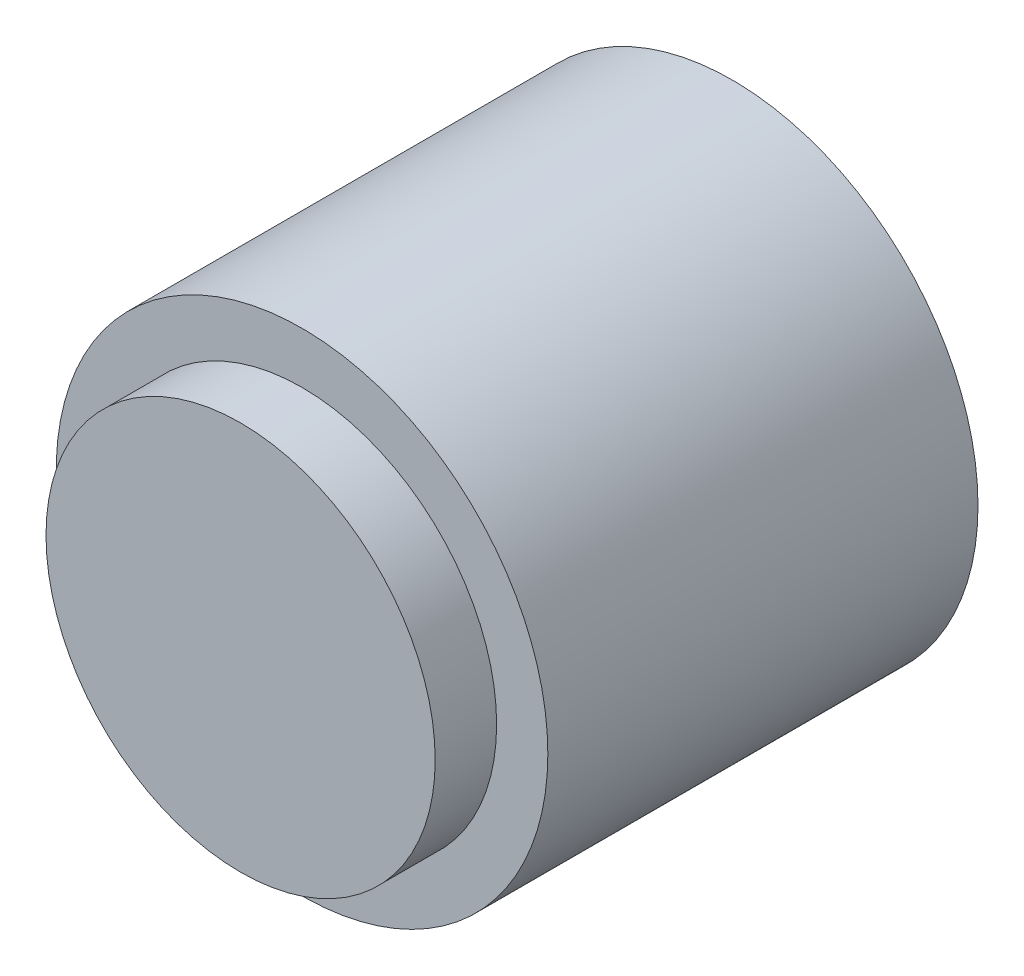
ISO-10303-21;
HEADER;
FILE_DESCRIPTION(('STEP AP214'),'2;1');
FILE_NAME('part.step','',(''),(''),'','','');
FILE_SCHEMA(('AUTOMOTIVE_DESIGN { 1 0 10303 214 1 1 1 1 }'));
ENDSEC;
DATA;
#1=APPLICATION_CONTEXT('core data for automotive mechanical design processes');
#2=APPLICATION_PROTOCOL_DEFINITION('international standard','automotive_design',2000,#1);
#3=PRODUCT_CONTEXT('',#1,'mechanical');
#4=PRODUCT('Part','Part','',(#3));
#5=PRODUCT_RELATED_PRODUCT_CATEGORY('part','',(#4));
#6=PRODUCT_DEFINITION_FORMATION('','',#4);
#7=PRODUCT_DEFINITION_CONTEXT('part definition',#1,'design');
#8=PRODUCT_DEFINITION('design','',#6,#7);
#9=PRODUCT_DEFINITION_SHAPE('','',#8);
#10=(LENGTH_UNIT() NAMED_UNIT(*) SI_UNIT(.MILLI.,.METRE.));
#11=(NAMED_UNIT(*) PLANE_ANGLE_UNIT() SI_UNIT($,.RADIAN.));
#12=(NAMED_UNIT(*) SI_UNIT($,.STERADIAN.) SOLID_ANGLE_UNIT());
#13=UNCERTAINTY_MEASURE_WITH_UNIT(LENGTH_MEASURE(1.E-05),#10,'distance_accuracy_value','');
#14=(GEOMETRIC_REPRESENTATION_CONTEXT(3) GLOBAL_UNCERTAINTY_ASSIGNED_CONTEXT((#13)) GLOBAL_UNIT_ASSIGNED_CONTEXT((#10,
#11,#12)) REPRESENTATION_CONTEXT('',''));
#15=CARTESIAN_POINT('',(0.,0.,0.));
#16=DIRECTION('',(0.,0.,1.));
#17=DIRECTION('',(1.,0.,0.));
#18=AXIS2_PLACEMENT_3D('',#15,#16,#17);
#19=CARTESIAN_POINT('',(0.,0.,32.));
#20=DIRECTION('',(0.,0.,1.));
#21=DIRECTION('',(1.,0.,0.));
#22=AXIS2_PLACEMENT_3D('',#19,#20,#21);
#23=CYLINDRICAL_SURFACE('',#22,6.);
#24=CARTESIAN_POINT('',(0.,0.,0.));
#25=DIRECTION('',(0.,0.,1.));
#26=DIRECTION('',(1.,0.,0.));
#27=AXIS2_PLACEMENT_3D('',#24,#25,#26);
#28=CIRCLE('',#27,6.);
#29=CARTESIAN_POINT('',(6.,0.,0.));
#30=VERTEX_POINT('',#29);
#31=EDGE_CURVE('E8',#30,#30,#28,.T.);
#32=ORIENTED_EDGE('',*,*,#31,.T.);
#33=EDGE_LOOP('',(#32));
#34=FACE_BOUND('',#33,.T.);
#35=CARTESIAN_POINT('',(0.,0.,10.5));
#36=DIRECTION('',(0.,0.,1.));
#37=DIRECTION('',(1.,0.,0.));
#38=AXIS2_PLACEMENT_3D('',#35,#36,#37);
#39=CIRCLE('',#38,6.);
#40=CARTESIAN_POINT('',(6.,0.,10.5));
#41=VERTEX_POINT('',#40);
#42=EDGE_CURVE('E28',#41,#41,#39,.T.);
#43=ORIENTED_EDGE('',*,*,#42,.F.);
#44=EDGE_LOOP('',(#43));
#45=FACE_BOUND('',#44,.T.);
#46=ADVANCED_FACE('F12',(#34,#45),#23,.T.);
#47=CARTESIAN_POINT('',(2.5,0.,0.));
#48=DIRECTION('',(0.,0.,1.));
#49=DIRECTION('',(1.,0.,0.));
#50=AXIS2_PLACEMENT_3D('',#47,#48,#49);
#51=PLANE('',#50);
#52=ORIENTED_EDGE('',*,*,#31,.F.);
#53=EDGE_LOOP('',(#52));
#54=FACE_BOUND('',#53,.T.);
#55=CARTESIAN_POINT('',(0.,0.,0.));
#56=DIRECTION('',(0.,0.,1.));
#57=DIRECTION('',(1.,0.,0.));
#58=AXIS2_PLACEMENT_3D('',#55,#56,#57);
#59=CIRCLE('',#58,2.5);
#60=CARTESIAN_POINT('',(2.5,0.,0.));
#61=VERTEX_POINT('',#60);
#62=EDGE_CURVE('E19',#61,#61,#59,.T.);
#63=ORIENTED_EDGE('',*,*,#62,.T.);
#64=EDGE_LOOP('',(#63));
#65=FACE_BOUND('',#64,.T.);
#66=ADVANCED_FACE('F41',(#54,#65),#51,.F.);
#67=CARTESIAN_POINT('',(0.,0.,32.));
#68=DIRECTION('',(0.,0.,1.));
#69=DIRECTION('',(1.,0.,0.));
#70=AXIS2_PLACEMENT_3D('',#67,#68,#69);
#71=CYLINDRICAL_SURFACE('',#70,2.5);
#72=CARTESIAN_POINT('',(0.,0.,8.));
#73=DIRECTION('',(0.,0.,-1.));
#74=DIRECTION('',(-1.,0.,0.));
#75=AXIS2_PLACEMENT_3D('',#72,#73,#74);
#76=CIRCLE('',#75,2.5);
#77=CARTESIAN_POINT('',(-2.5,0.,8.));
#78=VERTEX_POINT('',#77);
#79=EDGE_CURVE('E31',#78,#78,#76,.T.);
#80=ORIENTED_EDGE('',*,*,#79,.F.);
#81=EDGE_LOOP('',(#80));
#82=FACE_BOUND('',#81,.T.);
#83=ORIENTED_EDGE('',*,*,#62,.F.);
#84=EDGE_LOOP('',(#83));
#85=FACE_BOUND('',#84,.T.);
#86=ADVANCED_FACE('F37',(#82,#85),#71,.F.);
#87=CARTESIAN_POINT('',(0.,0.,20.));
#88=DIRECTION('',(0.,0.,1.));
#89=DIRECTION('',(1.,0.,0.));
#90=AXIS2_PLACEMENT_3D('',#87,#88,#89);
#91=CYLINDRICAL_SURFACE('',#90,4.75);
#92=CARTESIAN_POINT('',(0.,0.,10.5));
#93=DIRECTION('',(0.,0.,1.));
#94=DIRECTION('',(1.,0.,0.));
#95=AXIS2_PLACEMENT_3D('',#92,#93,#94);
#96=CIRCLE('',#95,4.75);
#97=CARTESIAN_POINT('',(4.75,0.,10.5));
#98=VERTEX_POINT('',#97);
#99=EDGE_CURVE('E25',#98,#98,#96,.T.);
#100=ORIENTED_EDGE('',*,*,#99,.T.);
#101=EDGE_LOOP('',(#100));
#102=FACE_BOUND('',#101,.T.);
#103=CARTESIAN_POINT('',(0.,0.,12.));
#104=DIRECTION('',(0.,0.,-1.));
#105=DIRECTION('',(-1.,0.,0.));
#106=AXIS2_PLACEMENT_3D('',#103,#104,#105);
#107=CIRCLE('',#106,4.75);
#108=CARTESIAN_POINT('',(-4.75,0.,12.));
#109=VERTEX_POINT('',#108);
#110=EDGE_CURVE('E15',#109,#109,#107,.T.);
#111=ORIENTED_EDGE('',*,*,#110,.T.);
#112=EDGE_LOOP('',(#111));
#113=FACE_BOUND('',#112,.T.);
#114=ADVANCED_FACE('F40',(#102,#113),#91,.T.);
#115=CARTESIAN_POINT('',(-4.75,0.,10.5));
#116=DIRECTION('',(0.,0.,1.));
#117=DIRECTION('',(1.,0.,0.));
#118=AXIS2_PLACEMENT_3D('',#115,#116,#117);
#119=PLANE('',#118);
#120=ORIENTED_EDGE('',*,*,#42,.T.);
#121=EDGE_LOOP('',(#120));
#122=FACE_BOUND('',#121,.T.);
#123=ORIENTED_EDGE('',*,*,#99,.F.);
#124=EDGE_LOOP('',(#123));
#125=FACE_BOUND('',#124,.T.);
#126=ADVANCED_FACE('F56',(#122,#125),#119,.T.);
#127=CARTESIAN_POINT('',(6.,0.,12.));
#128=DIRECTION('',(0.,0.,-1.));
#129=DIRECTION('',(-1.,0.,0.));
#130=AXIS2_PLACEMENT_3D('',#127,#128,#129);
#131=PLANE('',#130);
#132=ORIENTED_EDGE('',*,*,#110,.F.);
#133=EDGE_LOOP('',(#132));
#134=FACE_BOUND('',#133,.T.);
#135=ADVANCED_FACE('F53',(#134),#131,.F.);
#136=CARTESIAN_POINT('',(0.,0.,8.));
#137=DIRECTION('',(0.,0.,-1.));
#138=DIRECTION('',(-1.,0.,0.));
#139=AXIS2_PLACEMENT_3D('',#136,#137,#138);
#140=PLANE('',#139);
#141=ORIENTED_EDGE('',*,*,#79,.T.);
#142=EDGE_LOOP('',(#141));
#143=FACE_BOUND('',#142,.T.);
#144=ADVANCED_FACE('F35',(#143),#140,.T.);
#145=CLOSED_SHELL('',(#46,#66,#86,#114,#126,#135,#144));
#146=MANIFOLD_SOLID_BREP('B1',#145);
#147=ADVANCED_BREP_SHAPE_REPRESENTATION('',(#18,#146),#14);
#148=SHAPE_DEFINITION_REPRESENTATION(#9,#147);
ENDSEC;
END-ISO-10303-21;
